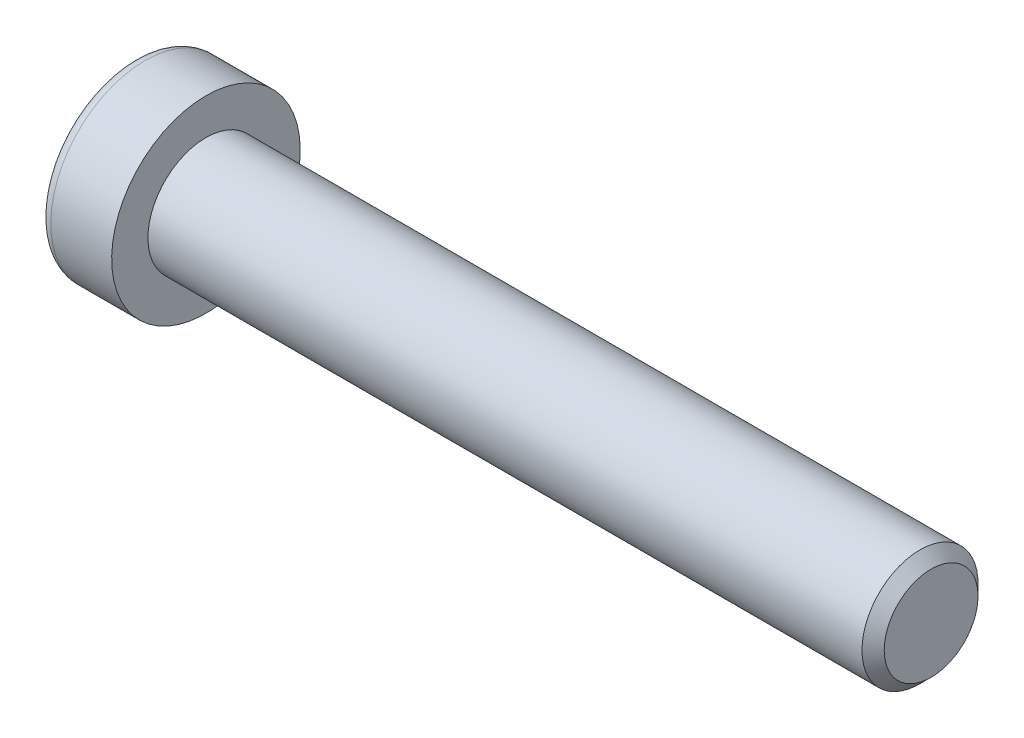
ISO-10303-21;
HEADER;
FILE_DESCRIPTION(('STEP AP214'),'2;1');
FILE_NAME('part.step','',(''),(''),'','','');
FILE_SCHEMA(('AUTOMOTIVE_DESIGN { 1 0 10303 214 1 1 1 1 }'));
ENDSEC;
DATA;
#1=APPLICATION_CONTEXT('core data for automotive mechanical design processes');
#2=APPLICATION_PROTOCOL_DEFINITION('international standard','automotive_design',2000,#1);
#3=PRODUCT_CONTEXT('',#1,'mechanical');
#4=PRODUCT('Part','Part','',(#3));
#5=PRODUCT_RELATED_PRODUCT_CATEGORY('part','',(#4));
#6=PRODUCT_DEFINITION_FORMATION('','',#4);
#7=PRODUCT_DEFINITION_CONTEXT('part definition',#1,'design');
#8=PRODUCT_DEFINITION('design','',#6,#7);
#9=PRODUCT_DEFINITION_SHAPE('','',#8);
#10=(LENGTH_UNIT() NAMED_UNIT(*) SI_UNIT(.MILLI.,.METRE.));
#11=(NAMED_UNIT(*) PLANE_ANGLE_UNIT() SI_UNIT($,.RADIAN.));
#12=(NAMED_UNIT(*) SI_UNIT($,.STERADIAN.) SOLID_ANGLE_UNIT());
#13=UNCERTAINTY_MEASURE_WITH_UNIT(LENGTH_MEASURE(1.E-05),#10,'distance_accuracy_value','');
#14=(GEOMETRIC_REPRESENTATION_CONTEXT(3) GLOBAL_UNCERTAINTY_ASSIGNED_CONTEXT((#13)) GLOBAL_UNIT_ASSIGNED_CONTEXT((#10,
#11,#12)) REPRESENTATION_CONTEXT('',''));
#15=CARTESIAN_POINT('',(0.,0.,0.));
#16=DIRECTION('',(0.,0.,1.));
#17=DIRECTION('',(1.,0.,0.));
#18=AXIS2_PLACEMENT_3D('',#15,#16,#17);
#19=CARTESIAN_POINT('',(-1.21000000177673,0.,0.));
#20=DIRECTION('',(-1.,0.,0.));
#21=DIRECTION('',(0.,0.,1.));
#22=AXIS2_PLACEMENT_3D('',#19,#20,#21);
#23=CONICAL_SURFACE('',#22,2.9040718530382,1.04719754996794);
#24=CARTESIAN_POINT('',(0.466666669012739,-1.13686837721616E-10,0.));
#25=VERTEX_POINT('',#24);
#26=VERTEX_LOOP('',#25);
#27=FACE_BOUND('',#26,.T.);
#28=CARTESIAN_POINT('',(-1.20000000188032,2.50000000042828,1.44337567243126));
#29=CARTESIAN_POINT('',(-1.16336943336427,2.50000000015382,1.31652043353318));
#30=CARTESIAN_POINT('',(-1.13005584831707,2.50000000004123,1.18857018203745));
#31=CARTESIAN_POINT('',(-1.07190798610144,2.49999999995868,0.930454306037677));
#32=CARTESIAN_POINT('',(-1.04709427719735,2.49999999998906,0.800284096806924));
#33=CARTESIAN_POINT('',(-1.00846995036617,2.50000000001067,0.541556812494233));
#34=CARTESIAN_POINT('',(-0.994402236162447,2.50000000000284,0.413039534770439));
#35=CARTESIAN_POINT('',(-0.977611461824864,2.49999999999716,0.155400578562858));
#36=CARTESIAN_POINT('',(-0.974874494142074,2.49999999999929,0.0262798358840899));
#37=CARTESIAN_POINT('',(-0.980582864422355,2.50000000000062,-0.21496841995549));
#38=CARTESIAN_POINT('',(-0.987626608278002,2.50000000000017,-0.327132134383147));
#39=CARTESIAN_POINT('',(-1.00994662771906,2.49999999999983,-0.550728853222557));
#40=CARTESIAN_POINT('',(-1.02523052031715,2.49999999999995,-0.66216108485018));
#41=CARTESIAN_POINT('',(-1.06343729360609,2.50000000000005,-0.886218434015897));
#42=CARTESIAN_POINT('',(-1.08652205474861,2.50000000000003,-0.998815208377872));
#43=CARTESIAN_POINT('',(-1.13891470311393,2.49999999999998,-1.2223298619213));
#44=CARTESIAN_POINT('',(-1.16821028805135,2.49999999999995,-1.33325060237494));
#45=CARTESIAN_POINT('',(-1.20000000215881,2.5,-1.44337567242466));
#46=B_SPLINE_CURVE_WITH_KNOTS('',3,(#28,#29,#30,#31,#32,#33,#34,#35,#36,#37,#38,#39,#40,#41,#42,
#43,#44,#45),.UNSPECIFIED.,.F.,.F.,(4,2,2,2,2,2,2,2,4),(0.,0.396270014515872,0.793492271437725,
1.18088450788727,1.56780111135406,1.90463472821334,2.24178024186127,2.58640202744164,
2.93034746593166),.UNSPECIFIED.);
#47=CARTESIAN_POINT('',(-1.20000000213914,2.49999999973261,1.44337567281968));
#48=VERTEX_POINT('',#47);
#49=CARTESIAN_POINT('',(-1.20000000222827,2.5,-1.44337567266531));
#50=VERTEX_POINT('',#49);
#51=EDGE_CURVE('E20',#48,#50,#46,.T.);
#52=ORIENTED_EDGE('',*,*,#51,.T.);
#53=CARTESIAN_POINT('',(-1.20000000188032,2.49999999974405,-1.44337567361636));
#54=CARTESIAN_POINT('',(-1.16336943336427,2.39014014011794,-1.50680329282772));
#55=CARTESIAN_POINT('',(-1.13005584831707,2.27933197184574,-1.57077841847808));
#56=CARTESIAN_POINT('',(-1.07190798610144,2.05579706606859,-1.69983635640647));
#57=CARTESIAN_POINT('',(-1.04709427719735,1.94306635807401,-1.76492146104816));
#58=CARTESIAN_POINT('',(-1.00846995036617,1.71900195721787,-1.89428510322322));
#59=CARTESIAN_POINT('',(-0.994402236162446,1.60770272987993,-1.95854374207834));
#60=CARTESIAN_POINT('',(-0.977611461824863,1.38458084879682,-2.08736322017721));
#61=CARTESIAN_POINT('',(-0.974874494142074,1.27275900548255,-2.15192359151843));
#62=CARTESIAN_POINT('',(-0.980582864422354,1.06383188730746,-2.27254771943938));
#63=CARTESIAN_POINT('',(-0.987626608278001,0.966695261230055,-2.32862957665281));
#64=CARTESIAN_POINT('',(-1.00994662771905,0.773054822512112,-2.44042793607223));
#65=CARTESIAN_POINT('',(-1.02523052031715,0.676551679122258,-2.49614405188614));
#66=CARTESIAN_POINT('',(-1.06343729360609,0.482512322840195,-2.60817272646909));
#67=CARTESIAN_POINT('',(-1.08652205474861,0.385000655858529,-2.66447111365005));
#68=CARTESIAN_POINT('',(-1.13891470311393,0.191431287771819,-2.77622844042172));
#69=CARTESIAN_POINT('',(-1.16821028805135,0.09537110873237,-2.83168881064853));
#70=CARTESIAN_POINT('',(-1.20000000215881,4.75795613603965E-10,-2.88675134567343));
#71=B_SPLINE_CURVE_WITH_KNOTS('',3,(#53,#54,#55,#56,#57,#58,#59,#60,#61,#62,#63,#64,#65,#66,#67,
#68,#69,#70),.UNSPECIFIED.,.F.,.F.,(4,2,2,2,2,2,2,2,4),(0.,0.396270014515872,0.793492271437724,
1.18088450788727,1.56780111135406,1.90463472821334,2.24178024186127,2.58640202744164,
2.93034746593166),.UNSPECIFIED.);
#72=CARTESIAN_POINT('',(-1.20000000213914,0.,-2.88675134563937));
#73=VERTEX_POINT('',#72);
#74=EDGE_CURVE('E80',#50,#73,#71,.T.);
#75=ORIENTED_EDGE('',*,*,#74,.T.);
#76=CARTESIAN_POINT('',(-1.20000000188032,-6.84219602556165E-10,-2.88675134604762));
#77=CARTESIAN_POINT('',(-1.16336943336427,-0.109859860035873,-2.8233237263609));
#78=CARTESIAN_POINT('',(-1.13005584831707,-0.220668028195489,-2.75934860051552));
#79=CARTESIAN_POINT('',(-1.07190798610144,-0.444202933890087,-2.63029066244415));
#80=CARTESIAN_POINT('',(-1.04709427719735,-0.556933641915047,-2.56520555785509));
#81=CARTESIAN_POINT('',(-1.00846995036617,-0.780998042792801,-2.43584191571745));
#82=CARTESIAN_POINT('',(-0.994402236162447,-0.892297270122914,-2.37158327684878));
#83=CARTESIAN_POINT('',(-0.977611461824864,-1.11541915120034,-2.24276379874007));
#84=CARTESIAN_POINT('',(-0.974874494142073,-1.22724099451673,-2.17820342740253));
#85=CARTESIAN_POINT('',(-0.980582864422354,-1.43616811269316,-2.05757929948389));
#86=CARTESIAN_POINT('',(-0.987626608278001,-1.53330473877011,-2.00149744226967));
#87=CARTESIAN_POINT('',(-1.00994662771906,-1.72694517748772,-1.88969908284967));
#88=CARTESIAN_POINT('',(-1.02523052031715,-1.82344832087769,-1.83398296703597));
#89=CARTESIAN_POINT('',(-1.06343729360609,-2.01748767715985,-1.72195429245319));
#90=CARTESIAN_POINT('',(-1.08652205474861,-2.1149993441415,-1.66565590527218));
#91=CARTESIAN_POINT('',(-1.13891470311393,-2.30856871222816,-1.55389857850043));
#92=CARTESIAN_POINT('',(-1.16821028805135,-2.40462889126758,-1.49843820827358));
#93=CARTESIAN_POINT('',(-1.20000000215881,-2.49999999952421,-1.44337567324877));
#94=B_SPLINE_CURVE_WITH_KNOTS('',3,(#76,#77,#78,#79,#80,#81,#82,#83,#84,#85,#86,#87,#88,#89,#90,
#91,#92,#93),.UNSPECIFIED.,.F.,.F.,(4,2,2,2,2,2,2,2,4),(0.,0.396270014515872,0.793492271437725,
1.18088450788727,1.56780111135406,1.90463472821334,2.24178024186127,2.58640202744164,
2.93034746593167),.UNSPECIFIED.);
#95=CARTESIAN_POINT('',(-1.20000000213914,-2.49999999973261,-1.44337567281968));
#96=VERTEX_POINT('',#95);
#97=EDGE_CURVE('E105',#73,#96,#94,.T.);
#98=ORIENTED_EDGE('',*,*,#97,.T.);
#99=CARTESIAN_POINT('',(-1.20000000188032,-2.50000000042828,-1.44337567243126));
#100=CARTESIAN_POINT('',(-1.16336943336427,-2.50000000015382,-1.31652043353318));
#101=CARTESIAN_POINT('',(-1.13005584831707,-2.50000000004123,-1.18857018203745));
#102=CARTESIAN_POINT('',(-1.07190798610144,-2.49999999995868,-0.93045430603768));
#103=CARTESIAN_POINT('',(-1.04709427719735,-2.49999999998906,-0.800284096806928));
#104=CARTESIAN_POINT('',(-1.00846995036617,-2.50000000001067,-0.541556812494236));
#105=CARTESIAN_POINT('',(-0.994402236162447,-2.50000000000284,-0.413039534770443));
#106=CARTESIAN_POINT('',(-0.977611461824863,-2.49999999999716,-0.155400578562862));
#107=CARTESIAN_POINT('',(-0.974874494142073,-2.49999999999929,-0.0262798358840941));
#108=CARTESIAN_POINT('',(-0.980582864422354,-2.50000000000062,0.214968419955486));
#109=CARTESIAN_POINT('',(-0.987626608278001,-2.50000000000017,0.327132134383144));
#110=CARTESIAN_POINT('',(-1.00994662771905,-2.49999999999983,0.550728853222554));
#111=CARTESIAN_POINT('',(-1.02523052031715,-2.49999999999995,0.662161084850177));
#112=CARTESIAN_POINT('',(-1.06343729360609,-2.50000000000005,0.886218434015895));
#113=CARTESIAN_POINT('',(-1.08652205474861,-2.50000000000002,0.99881520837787));
#114=CARTESIAN_POINT('',(-1.13891470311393,-2.49999999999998,1.2223298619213));
#115=CARTESIAN_POINT('',(-1.16821028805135,-2.49999999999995,1.33325060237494));
#116=CARTESIAN_POINT('',(-1.20000000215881,-2.5,1.44337567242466));
#117=B_SPLINE_CURVE_WITH_KNOTS('',3,(#99,#100,#101,#102,#103,#104,#105,#106,#107,#108,#109,#110,
#111,#112,#113,#114,#115,#116),.UNSPECIFIED.,.F.,.F.,(4,2,2,2,2,2,2,2,4),(0.,0.396270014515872,
0.793492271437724,1.18088450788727,1.56780111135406,1.90463472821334,2.24178024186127,
2.58640202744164,2.93034746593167),.UNSPECIFIED.);
#118=CARTESIAN_POINT('',(-1.20000000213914,-2.49999999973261,1.44337567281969));
#119=VERTEX_POINT('',#118);
#120=EDGE_CURVE('E129',#96,#119,#117,.T.);
#121=ORIENTED_EDGE('',*,*,#120,.T.);
#122=CARTESIAN_POINT('',(-1.20000000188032,-2.49999999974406,1.44337567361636));
#123=CARTESIAN_POINT('',(-1.16336943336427,-2.39014014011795,1.50680329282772));
#124=CARTESIAN_POINT('',(-1.13005584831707,-2.27933197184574,1.57077841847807));
#125=CARTESIAN_POINT('',(-1.07190798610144,-2.05579706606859,1.69983635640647));
#126=CARTESIAN_POINT('',(-1.04709427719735,-1.94306635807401,1.76492146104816));
#127=CARTESIAN_POINT('',(-1.00846995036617,-1.71900195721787,1.89428510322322));
#128=CARTESIAN_POINT('',(-0.994402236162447,-1.60770272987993,1.95854374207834));
#129=CARTESIAN_POINT('',(-0.977611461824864,-1.38458084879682,2.08736322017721));
#130=CARTESIAN_POINT('',(-0.974874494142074,-1.27275900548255,2.15192359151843));
#131=CARTESIAN_POINT('',(-0.980582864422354,-1.06383188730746,2.27254771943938));
#132=CARTESIAN_POINT('',(-0.987626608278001,-0.966695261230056,2.32862957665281));
#133=CARTESIAN_POINT('',(-1.00994662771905,-0.773054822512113,2.44042793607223));
#134=CARTESIAN_POINT('',(-1.02523052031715,-0.676551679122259,2.49614405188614));
#135=CARTESIAN_POINT('',(-1.06343729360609,-0.482512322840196,2.60817272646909));
#136=CARTESIAN_POINT('',(-1.08652205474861,-0.385000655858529,2.66447111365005));
#137=CARTESIAN_POINT('',(-1.13891470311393,-0.19143128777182,2.77622844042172));
#138=CARTESIAN_POINT('',(-1.16821028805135,-0.0953711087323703,2.83168881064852));
#139=CARTESIAN_POINT('',(-1.20000000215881,-4.75795563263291E-10,2.88675134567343));
#140=B_SPLINE_CURVE_WITH_KNOTS('',3,(#122,#123,#124,#125,#126,#127,#128,#129,#130,#131,#132,
#133,#134,#135,#136,#137,#138,#139),.UNSPECIFIED.,.F.,.F.,(4,2,2,2,2,2,2,2,4),(0.,
0.396270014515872,0.793492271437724,1.18088450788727,1.56780111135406,1.90463472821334,
2.24178024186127,2.58640202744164,2.93034746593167),.UNSPECIFIED.);
#141=CARTESIAN_POINT('',(-1.20000000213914,0.,2.88675134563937));
#142=VERTEX_POINT('',#141);
#143=EDGE_CURVE('E137',#119,#142,#140,.T.);
#144=ORIENTED_EDGE('',*,*,#143,.T.);
#145=CARTESIAN_POINT('',(-1.20000000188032,6.84218568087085E-10,2.88675134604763));
#146=CARTESIAN_POINT('',(-1.16336943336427,0.109859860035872,2.8233237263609));
#147=CARTESIAN_POINT('',(-1.13005584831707,0.220668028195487,2.75934860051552));
#148=CARTESIAN_POINT('',(-1.07190798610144,0.444202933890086,2.63029066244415));
#149=CARTESIAN_POINT('',(-1.04709427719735,0.556933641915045,2.56520555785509));
#150=CARTESIAN_POINT('',(-1.00846995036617,0.7809980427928,2.43584191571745));
#151=CARTESIAN_POINT('',(-0.994402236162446,0.892297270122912,2.37158327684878));
#152=CARTESIAN_POINT('',(-0.977611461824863,1.11541915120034,2.24276379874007));
#153=CARTESIAN_POINT('',(-0.974874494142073,1.22724099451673,2.17820342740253));
#154=CARTESIAN_POINT('',(-0.980582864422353,1.43616811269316,2.05757929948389));
#155=CARTESIAN_POINT('',(-0.987626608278,1.53330473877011,2.00149744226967));
#156=CARTESIAN_POINT('',(-1.00994662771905,1.72694517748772,1.88969908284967));
#157=CARTESIAN_POINT('',(-1.02523052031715,1.82344832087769,1.83398296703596));
#158=CARTESIAN_POINT('',(-1.06343729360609,2.01748767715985,1.72195429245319));
#159=CARTESIAN_POINT('',(-1.08652205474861,2.1149993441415,1.66565590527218));
#160=CARTESIAN_POINT('',(-1.13891470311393,2.30856871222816,1.55389857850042));
#161=CARTESIAN_POINT('',(-1.16821028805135,2.40462889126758,1.49843820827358));
#162=CARTESIAN_POINT('',(-1.2000000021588,2.49999999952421,1.44337567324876));
#163=B_SPLINE_CURVE_WITH_KNOTS('',3,(#145,#146,#147,#148,#149,#150,#151,#152,#153,#154,#155,
#156,#157,#158,#159,#160,#161,#162),.UNSPECIFIED.,.F.,.F.,(4,2,2,2,2,2,2,2,4),(0.,
0.396270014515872,0.793492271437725,1.18088450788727,1.56780111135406,1.90463472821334,
2.24178024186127,2.58640202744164,2.93034746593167),.UNSPECIFIED.);
#164=EDGE_CURVE('E82',#142,#48,#163,.T.);
#165=ORIENTED_EDGE('',*,*,#164,.T.);
#166=EDGE_LOOP('',(#52,#75,#98,#121,#144,#165));
#167=FACE_BOUND('',#166,.T.);
#168=ADVANCED_FACE('F16',(#27,#167),#23,.F.);
#169=CARTESIAN_POINT('',(-5.,2.5,1.44337567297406));
#170=DIRECTION('',(0.,1.,0.));
#171=DIRECTION('',(0.,0.,1.));
#172=AXIS2_PLACEMENT_3D('',#169,#170,#171);
#173=PLANE('',#172);
#174=DIRECTION('',(1.,0.,0.));
#175=VECTOR('',#174,1.);
#176=CARTESIAN_POINT('',(-5.,2.5,1.44337567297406));
#177=LINE('',#176,#175);
#178=CARTESIAN_POINT('',(-5.,2.5,1.44337567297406));
#179=VERTEX_POINT('',#178);
#180=EDGE_CURVE('E84',#48,#179,#177,.F.);
#181=ORIENTED_EDGE('',*,*,#180,.T.);
#182=DIRECTION('',(0.,0.,1.));
#183=VECTOR('',#182,1.);
#184=CARTESIAN_POINT('',(-5.,2.5,0.));
#185=LINE('',#184,#183);
#186=CARTESIAN_POINT('',(-5.,2.5,-1.44337567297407));
#187=VERTEX_POINT('',#186);
#188=EDGE_CURVE('E89',#187,#179,#185,.T.);
#189=ORIENTED_EDGE('',*,*,#188,.F.);
#190=DIRECTION('',(1.,0.,0.));
#191=VECTOR('',#190,1.);
#192=CARTESIAN_POINT('',(-5.,2.5,-1.44337567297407));
#193=LINE('',#192,#191);
#194=EDGE_CURVE('E87',#187,#50,#193,.T.);
#195=ORIENTED_EDGE('',*,*,#194,.T.);
#196=ORIENTED_EDGE('',*,*,#51,.F.);
#197=EDGE_LOOP('',(#181,#189,#195,#196));
#198=FACE_BOUND('',#197,.T.);
#199=ADVANCED_FACE('F76',(#198),#173,.F.);
#200=CARTESIAN_POINT('',(-5.,0.,2.88675134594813));
#201=DIRECTION('',(0.,0.500000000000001,0.866025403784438));
#202=DIRECTION('',(0.,-0.866025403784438,0.500000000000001));
#203=AXIS2_PLACEMENT_3D('',#200,#201,#202);
#204=PLANE('',#203);
#205=DIRECTION('',(1.,0.,0.));
#206=VECTOR('',#205,1.);
#207=CARTESIAN_POINT('',(-5.,0.,2.88675134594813));
#208=LINE('',#207,#206);
#209=CARTESIAN_POINT('',(-5.,0.,2.88675134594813));
#210=VERTEX_POINT('',#209);
#211=EDGE_CURVE('E141',#142,#210,#208,.F.);
#212=ORIENTED_EDGE('',*,*,#211,.T.);
#213=DIRECTION('',(0.,-0.866025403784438,0.500000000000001));
#214=VECTOR('',#213,1.);
#215=CARTESIAN_POINT('',(-5.,2.5,1.44337567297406));
#216=LINE('',#215,#214);
#217=EDGE_CURVE('E95',#179,#210,#216,.T.);
#218=ORIENTED_EDGE('',*,*,#217,.F.);
#219=ORIENTED_EDGE('',*,*,#180,.F.);
#220=ORIENTED_EDGE('',*,*,#164,.F.);
#221=EDGE_LOOP('',(#212,#218,#219,#220));
#222=FACE_BOUND('',#221,.T.);
#223=ADVANCED_FACE('F145',(#222),#204,.F.);
#224=CARTESIAN_POINT('',(-5.,-2.5,1.44337567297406));
#225=DIRECTION('',(0.,-0.5,0.866025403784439));
#226=DIRECTION('',(0.,-0.866025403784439,-0.5));
#227=AXIS2_PLACEMENT_3D('',#224,#225,#226);
#228=PLANE('',#227);
#229=DIRECTION('',(1.,0.,0.));
#230=VECTOR('',#229,1.);
#231=CARTESIAN_POINT('',(-5.,-2.5,1.44337567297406));
#232=LINE('',#231,#230);
#233=CARTESIAN_POINT('',(-5.,-2.5,1.44337567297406));
#234=VERTEX_POINT('',#233);
#235=EDGE_CURVE('E136',#119,#234,#232,.F.);
#236=ORIENTED_EDGE('',*,*,#235,.T.);
#237=DIRECTION('',(0.,-0.866025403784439,-0.5));
#238=VECTOR('',#237,1.);
#239=CARTESIAN_POINT('',(-5.,0.,2.88675134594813));
#240=LINE('',#239,#238);
#241=EDGE_CURVE('E224',#210,#234,#240,.T.);
#242=ORIENTED_EDGE('',*,*,#241,.F.);
#243=ORIENTED_EDGE('',*,*,#211,.F.);
#244=ORIENTED_EDGE('',*,*,#143,.F.);
#245=EDGE_LOOP('',(#236,#242,#243,#244));
#246=FACE_BOUND('',#245,.T.);
#247=ADVANCED_FACE('F125',(#246),#228,.F.);
#248=CARTESIAN_POINT('',(-5.,-2.5,-1.44337567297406));
#249=DIRECTION('',(0.,-1.,0.));
#250=DIRECTION('',(0.,0.,-1.));
#251=AXIS2_PLACEMENT_3D('',#248,#249,#250);
#252=PLANE('',#251);
#253=DIRECTION('',(1.,0.,0.));
#254=VECTOR('',#253,1.);
#255=CARTESIAN_POINT('',(-5.,-2.5,-1.44337567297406));
#256=LINE('',#255,#254);
#257=CARTESIAN_POINT('',(-5.,-2.5,-1.44337567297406));
#258=VERTEX_POINT('',#257);
#259=EDGE_CURVE('E135',#96,#258,#256,.F.);
#260=ORIENTED_EDGE('',*,*,#259,.T.);
#261=DIRECTION('',(0.,0.,1.));
#262=VECTOR('',#261,1.);
#263=CARTESIAN_POINT('',(-5.,-2.5,0.));
#264=LINE('',#263,#262);
#265=EDGE_CURVE('E221',#234,#258,#264,.F.);
#266=ORIENTED_EDGE('',*,*,#265,.F.);
#267=ORIENTED_EDGE('',*,*,#235,.F.);
#268=ORIENTED_EDGE('',*,*,#120,.F.);
#269=EDGE_LOOP('',(#260,#266,#267,#268));
#270=FACE_BOUND('',#269,.T.);
#271=ADVANCED_FACE('F121',(#270),#252,.F.);
#272=CARTESIAN_POINT('',(-5.,0.,-2.88675134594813));
#273=DIRECTION('',(0.,-0.5,-0.866025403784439));
#274=DIRECTION('',(0.,0.866025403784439,-0.5));
#275=AXIS2_PLACEMENT_3D('',#272,#273,#274);
#276=PLANE('',#275);
#277=DIRECTION('',(1.,0.,0.));
#278=VECTOR('',#277,1.);
#279=CARTESIAN_POINT('',(-5.,0.,-2.88675134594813));
#280=LINE('',#279,#278);
#281=CARTESIAN_POINT('',(-5.,0.,-2.88675134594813));
#282=VERTEX_POINT('',#281);
#283=EDGE_CURVE('E38',#73,#282,#280,.F.);
#284=ORIENTED_EDGE('',*,*,#283,.T.);
#285=DIRECTION('',(0.,0.866025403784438,-0.500000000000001));
#286=VECTOR('',#285,1.);
#287=CARTESIAN_POINT('',(-5.,-2.5,-1.44337567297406));
#288=LINE('',#287,#286);
#289=EDGE_CURVE('E218',#258,#282,#288,.T.);
#290=ORIENTED_EDGE('',*,*,#289,.F.);
#291=ORIENTED_EDGE('',*,*,#259,.F.);
#292=ORIENTED_EDGE('',*,*,#97,.F.);
#293=EDGE_LOOP('',(#284,#290,#291,#292));
#294=FACE_BOUND('',#293,.T.);
#295=ADVANCED_FACE('F115',(#294),#276,.F.);
#296=CARTESIAN_POINT('',(-5.,2.5,-1.44337567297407));
#297=DIRECTION('',(0.,0.5,-0.866025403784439));
#298=DIRECTION('',(0.,0.866025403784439,0.5));
#299=AXIS2_PLACEMENT_3D('',#296,#297,#298);
#300=PLANE('',#299);
#301=ORIENTED_EDGE('',*,*,#194,.F.);
#302=DIRECTION('',(0.,0.866025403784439,0.5));
#303=VECTOR('',#302,1.);
#304=CARTESIAN_POINT('',(-5.,0.,-2.88675134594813));
#305=LINE('',#304,#303);
#306=EDGE_CURVE('E216',#282,#187,#305,.T.);
#307=ORIENTED_EDGE('',*,*,#306,.F.);
#308=ORIENTED_EDGE('',*,*,#283,.F.);
#309=ORIENTED_EDGE('',*,*,#74,.F.);
#310=EDGE_LOOP('',(#301,#307,#308,#309));
#311=FACE_BOUND('',#310,.T.);
#312=ADVANCED_FACE('F93',(#311),#300,.F.);
#313=CARTESIAN_POINT('',(-5.,4.69337567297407,0.));
#314=DIRECTION('',(-1.,0.,0.));
#315=DIRECTION('',(0.,0.,1.));
#316=AXIS2_PLACEMENT_3D('',#313,#314,#315);
#317=PLANE('',#316);
#318=ORIENTED_EDGE('',*,*,#289,.T.);
#319=ORIENTED_EDGE('',*,*,#306,.T.);
#320=ORIENTED_EDGE('',*,*,#188,.T.);
#321=ORIENTED_EDGE('',*,*,#217,.T.);
#322=ORIENTED_EDGE('',*,*,#241,.T.);
#323=ORIENTED_EDGE('',*,*,#265,.T.);
#324=EDGE_LOOP('',(#318,#319,#320,#321,#322,#323));
#325=FACE_BOUND('',#324,.T.);
#326=CARTESIAN_POINT('',(-5.,0.,0.));
#327=DIRECTION('',(1.,0.,0.));
#328=DIRECTION('',(0.,1.,0.));
#329=AXIS2_PLACEMENT_3D('',#326,#327,#328);
#330=CIRCLE('',#329,5.7);
#331=CARTESIAN_POINT('',(-5.,5.7,0.));
#332=VERTEX_POINT('',#331);
#333=EDGE_CURVE('E193',#332,#332,#330,.T.);
#334=ORIENTED_EDGE('',*,*,#333,.F.);
#335=EDGE_LOOP('',(#334));
#336=FACE_BOUND('',#335,.T.);
#337=ADVANCED_FACE('F114',(#325,#336),#317,.T.);
#338=CARTESIAN_POINT('',(-4.2,0.,0.));
#339=DIRECTION('',(1.,0.,0.));
#340=DIRECTION('',(0.,0.,-1.));
#341=AXIS2_PLACEMENT_3D('',#338,#339,#340);
#342=TOROIDAL_SURFACE('',#341,5.7,0.8);
#343=CARTESIAN_POINT('',(-4.2,0.,0.));
#344=DIRECTION('',(1.,0.,0.));
#345=DIRECTION('',(0.,1.,0.));
#346=AXIS2_PLACEMENT_3D('',#343,#344,#345);
#347=CIRCLE('',#346,6.5);
#348=CARTESIAN_POINT('',(-4.2,6.5,0.));
#349=VERTEX_POINT('',#348);
#350=EDGE_CURVE('E234',#349,#349,#347,.T.);
#351=ORIENTED_EDGE('',*,*,#350,.F.);
#352=EDGE_LOOP('',(#351));
#353=FACE_BOUND('',#352,.T.);
#354=ORIENTED_EDGE('',*,*,#333,.T.);
#355=EDGE_LOOP('',(#354));
#356=FACE_BOUND('',#355,.T.);
#357=ADVANCED_FACE('F177',(#353,#356),#342,.T.);
#358=CARTESIAN_POINT('',(-2.5,0.,0.));
#359=DIRECTION('',(1.,0.,0.));
#360=DIRECTION('',(0.,1.,0.));
#361=AXIS2_PLACEMENT_3D('',#358,#359,#360);
#362=CYLINDRICAL_SURFACE('',#361,6.5);
#363=ORIENTED_EDGE('',*,*,#350,.T.);
#364=EDGE_LOOP('',(#363));
#365=FACE_BOUND('',#364,.T.);
#366=CARTESIAN_POINT('',(0.,0.,0.));
#367=DIRECTION('',(1.,0.,0.));
#368=DIRECTION('',(0.,1.,0.));
#369=AXIS2_PLACEMENT_3D('',#366,#367,#368);
#370=CIRCLE('',#369,6.5);
#371=CARTESIAN_POINT('',(0.,6.5,0.));
#372=VERTEX_POINT('',#371);
#373=EDGE_CURVE('E103',#372,#372,#370,.T.);
#374=ORIENTED_EDGE('',*,*,#373,.F.);
#375=EDGE_LOOP('',(#374));
#376=FACE_BOUND('',#375,.T.);
#377=ADVANCED_FACE('F174',(#365,#376),#362,.T.);
#378=CARTESIAN_POINT('',(50.,2.,0.));
#379=DIRECTION('',(1.,0.,0.));
#380=DIRECTION('',(0.,0.,-1.));
#381=AXIS2_PLACEMENT_3D('',#378,#379,#380);
#382=PLANE('',#381);
#383=CARTESIAN_POINT('',(50.0000000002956,0.,0.));
#384=DIRECTION('',(-1.,0.,0.));
#385=DIRECTION('',(0.,0.,1.));
#386=AXIS2_PLACEMENT_3D('',#383,#384,#385);
#387=CIRCLE('',#386,3.2331875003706);
#388=CARTESIAN_POINT('',(50.0000000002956,0.,3.2331875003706));
#389=VERTEX_POINT('',#388);
#390=EDGE_CURVE('E230',#389,#389,#387,.T.);
#391=ORIENTED_EDGE('',*,*,#390,.F.);
#392=EDGE_LOOP('',(#391));
#393=FACE_BOUND('',#392,.T.);
#394=ADVANCED_FACE('F170',(#393),#382,.T.);
#395=CARTESIAN_POINT('',(0.,5.25,0.));
#396=DIRECTION('',(1.,0.,0.));
#397=DIRECTION('',(0.,0.,-1.));
#398=AXIS2_PLACEMENT_3D('',#395,#396,#397);
#399=PLANE('',#398);
#400=CARTESIAN_POINT('',(0.,0.,0.));
#401=DIRECTION('',(1.,0.,0.));
#402=DIRECTION('',(0.,1.,0.));
#403=AXIS2_PLACEMENT_3D('',#400,#401,#402);
#404=CIRCLE('',#403,4.);
#405=CARTESIAN_POINT('',(0.,4.,0.));
#406=VERTEX_POINT('',#405);
#407=EDGE_CURVE('E29',#406,#406,#404,.T.);
#408=ORIENTED_EDGE('',*,*,#407,.F.);
#409=EDGE_LOOP('',(#408));
#410=FACE_BOUND('',#409,.T.);
#411=ORIENTED_EDGE('',*,*,#373,.T.);
#412=EDGE_LOOP('',(#411));
#413=FACE_BOUND('',#412,.T.);
#414=ADVANCED_FACE('F163',(#410,#413),#399,.T.);
#415=CARTESIAN_POINT('',(49.2331874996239,0.,0.));
#416=DIRECTION('',(-1.,0.,0.));
#417=DIRECTION('',(0.,0.,1.));
#418=AXIS2_PLACEMENT_3D('',#415,#416,#417);
#419=CONICAL_SURFACE('',#418,3.99999999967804,0.785398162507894);
#420=ORIENTED_EDGE('',*,*,#390,.T.);
#421=EDGE_LOOP('',(#420));
#422=FACE_BOUND('',#421,.T.);
#423=CARTESIAN_POINT('',(49.2331875,0.,0.));
#424=DIRECTION('',(1.,0.,0.));
#425=DIRECTION('',(0.,1.,0.));
#426=AXIS2_PLACEMENT_3D('',#423,#424,#425);
#427=CIRCLE('',#426,4.);
#428=CARTESIAN_POINT('',(49.2331875,4.,0.));
#429=VERTEX_POINT('',#428);
#430=EDGE_CURVE('E11',#429,#429,#427,.F.);
#431=ORIENTED_EDGE('',*,*,#430,.F.);
#432=EDGE_LOOP('',(#431));
#433=FACE_BOUND('',#432,.T.);
#434=ADVANCED_FACE('F156',(#422,#433),#419,.T.);
#435=CARTESIAN_POINT('',(39.,0.,0.));
#436=DIRECTION('',(1.,0.,0.));
#437=DIRECTION('',(0.,1.,0.));
#438=AXIS2_PLACEMENT_3D('',#435,#436,#437);
#439=CYLINDRICAL_SURFACE('',#438,4.);
#440=ORIENTED_EDGE('',*,*,#430,.T.);
#441=EDGE_LOOP('',(#440));
#442=FACE_BOUND('',#441,.T.);
#443=ORIENTED_EDGE('',*,*,#407,.T.);
#444=EDGE_LOOP('',(#443));
#445=FACE_BOUND('',#444,.T.);
#446=ADVANCED_FACE('F154',(#442,#445),#439,.T.);
#447=CLOSED_SHELL('',(#168,#199,#223,#247,#271,#295,#312,#337,#357,#377,#394,#414,#434,#446));
#448=MANIFOLD_SOLID_BREP('B1',#447);
#449=ADVANCED_BREP_SHAPE_REPRESENTATION('',(#18,#448),#14);
#450=SHAPE_DEFINITION_REPRESENTATION(#9,#449);
ENDSEC;
END-ISO-10303-21;
